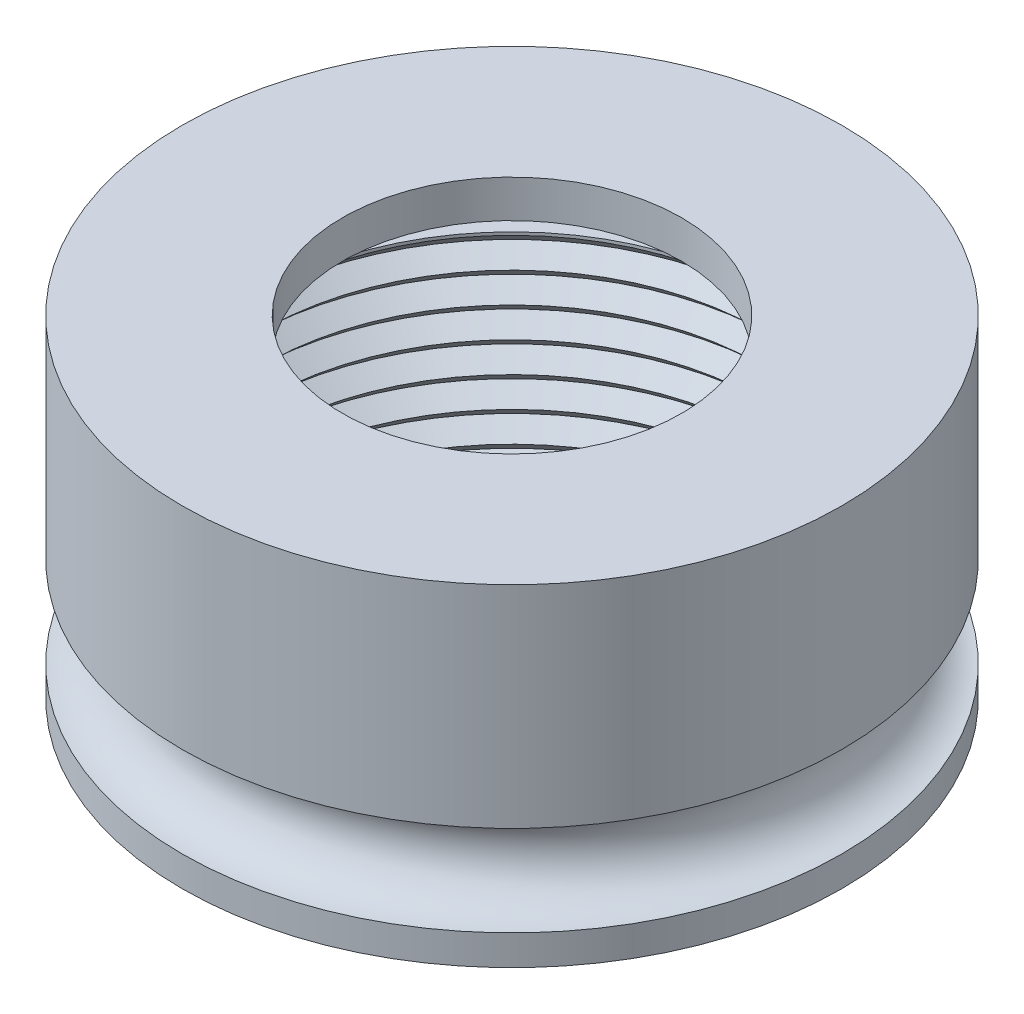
ISO-10303-21;
HEADER;
FILE_DESCRIPTION(('STEP AP214'),'2;1');
FILE_NAME('part.step','',(''),(''),'','','');
FILE_SCHEMA(('AUTOMOTIVE_DESIGN { 1 0 10303 214 1 1 1 1 }'));
ENDSEC;
DATA;
#1=APPLICATION_CONTEXT('core data for automotive mechanical design processes');
#2=APPLICATION_PROTOCOL_DEFINITION('international standard','automotive_design',2000,#1);
#3=PRODUCT_CONTEXT('',#1,'mechanical');
#4=PRODUCT('Part','Part','',(#3));
#5=PRODUCT_RELATED_PRODUCT_CATEGORY('part','',(#4));
#6=PRODUCT_DEFINITION_FORMATION('','',#4);
#7=PRODUCT_DEFINITION_CONTEXT('part definition',#1,'design');
#8=PRODUCT_DEFINITION('design','',#6,#7);
#9=PRODUCT_DEFINITION_SHAPE('','',#8);
#10=(LENGTH_UNIT() NAMED_UNIT(*) SI_UNIT(.MILLI.,.METRE.));
#11=(NAMED_UNIT(*) PLANE_ANGLE_UNIT() SI_UNIT($,.RADIAN.));
#12=(NAMED_UNIT(*) SI_UNIT($,.STERADIAN.) SOLID_ANGLE_UNIT());
#13=UNCERTAINTY_MEASURE_WITH_UNIT(LENGTH_MEASURE(1.E-05),#10,'distance_accuracy_value','');
#14=(GEOMETRIC_REPRESENTATION_CONTEXT(3) GLOBAL_UNCERTAINTY_ASSIGNED_CONTEXT((#13)) GLOBAL_UNIT_ASSIGNED_CONTEXT((#10,
#11,#12)) REPRESENTATION_CONTEXT('',''));
#15=CARTESIAN_POINT('',(0.,0.,0.));
#16=DIRECTION('',(0.,0.,1.));
#17=DIRECTION('',(1.,0.,0.));
#18=AXIS2_PLACEMENT_3D('',#15,#16,#17);
#19=CARTESIAN_POINT('',(0.,0.,0.));
#20=DIRECTION('',(0.,-1.,0.));
#21=DIRECTION('',(0.,0.,-1.));
#22=AXIS2_PLACEMENT_3D('',#19,#20,#21);
#23=CYLINDRICAL_SURFACE('',#22,13.890625);
#24=CARTESIAN_POINT('',(0.,-11.1125,0.));
#25=DIRECTION('',(0.,1.,0.));
#26=DIRECTION('',(0.,0.,1.));
#27=AXIS2_PLACEMENT_3D('',#24,#25,#26);
#28=CIRCLE('',#27,13.890625);
#29=CARTESIAN_POINT('',(0.,-11.1125,13.890625));
#30=VERTEX_POINT('',#29);
#31=EDGE_CURVE('E38',#30,#30,#28,.T.);
#32=ORIENTED_EDGE('',*,*,#31,.F.);
#33=EDGE_LOOP('',(#32));
#34=FACE_BOUND('',#33,.T.);
#35=CARTESIAN_POINT('',(0.,-12.3825,0.));
#36=DIRECTION('',(0.,-1.,0.));
#37=DIRECTION('',(0.,0.,-1.));
#38=AXIS2_PLACEMENT_3D('',#35,#36,#37);
#39=CIRCLE('',#38,13.890625);
#40=CARTESIAN_POINT('',(0.,-12.3825,-13.890625));
#41=VERTEX_POINT('',#40);
#42=EDGE_CURVE('E117',#41,#41,#39,.T.);
#43=ORIENTED_EDGE('',*,*,#42,.F.);
#44=EDGE_LOOP('',(#43));
#45=FACE_BOUND('',#44,.T.);
#46=ADVANCED_FACE('F34',(#34,#45),#23,.T.);
#47=CARTESIAN_POINT('',(11.1125,0.,0.));
#48=DIRECTION('',(0.,-1.,0.));
#49=DIRECTION('',(0.,0.,-1.));
#50=AXIS2_PLACEMENT_3D('',#47,#48,#49);
#51=PLANE('',#50);
#52=CARTESIAN_POINT('',(0.,0.,0.));
#53=DIRECTION('',(0.,-1.,0.));
#54=DIRECTION('',(0.,0.,-1.));
#55=AXIS2_PLACEMENT_3D('',#52,#53,#54);
#56=CIRCLE('',#55,11.1125);
#57=CARTESIAN_POINT('',(0.,0.,-11.1125));
#58=VERTEX_POINT('',#57);
#59=EDGE_CURVE('E55',#58,#58,#56,.T.);
#60=ORIENTED_EDGE('',*,*,#59,.T.);
#61=EDGE_LOOP('',(#60));
#62=FACE_BOUND('',#61,.T.);
#63=CARTESIAN_POINT('',(0.,0.,0.));
#64=DIRECTION('',(0.,-1.,0.));
#65=DIRECTION('',(0.,0.,-1.));
#66=AXIS2_PLACEMENT_3D('',#63,#64,#65);
#67=CIRCLE('',#66,7.14375);
#68=CARTESIAN_POINT('',(0.,0.,-7.14375));
#69=VERTEX_POINT('',#68);
#70=EDGE_CURVE('E10',#69,#69,#67,.T.);
#71=ORIENTED_EDGE('',*,*,#70,.F.);
#72=EDGE_LOOP('',(#71));
#73=FACE_BOUND('',#72,.T.);
#74=ADVANCED_FACE('F36',(#62,#73),#51,.T.);
#75=CARTESIAN_POINT('',(0.,0.,0.));
#76=DIRECTION('',(0.,-1.,0.));
#77=DIRECTION('',(0.,0.,-1.));
#78=AXIS2_PLACEMENT_3D('',#75,#76,#77);
#79=CYLINDRICAL_SURFACE('',#78,7.14375);
#80=ORIENTED_EDGE('',*,*,#70,.T.);
#81=EDGE_LOOP('',(#80));
#82=FACE_BOUND('',#81,.T.);
#83=CARTESIAN_POINT('',(0.,1.5875,0.));
#84=DIRECTION('',(0.,-1.,0.));
#85=DIRECTION('',(0.,0.,-1.));
#86=AXIS2_PLACEMENT_3D('',#83,#84,#85);
#87=CIRCLE('',#86,7.14375);
#88=CARTESIAN_POINT('',(0.,1.5875,-7.14375));
#89=VERTEX_POINT('',#88);
#90=EDGE_CURVE('E42',#89,#89,#87,.T.);
#91=ORIENTED_EDGE('',*,*,#90,.F.);
#92=EDGE_LOOP('',(#91));
#93=FACE_BOUND('',#92,.T.);
#94=ADVANCED_FACE('F126',(#82,#93),#79,.F.);
#95=CARTESIAN_POINT('',(7.14375,1.5875,0.));
#96=DIRECTION('',(0.,1.,0.));
#97=DIRECTION('',(0.,0.,1.));
#98=AXIS2_PLACEMENT_3D('',#95,#96,#97);
#99=PLANE('',#98);
#100=ORIENTED_EDGE('',*,*,#90,.T.);
#101=EDGE_LOOP('',(#100));
#102=FACE_BOUND('',#101,.T.);
#103=CARTESIAN_POINT('',(0.,1.5875,0.));
#104=DIRECTION('',(0.,-1.,0.));
#105=DIRECTION('',(0.,0.,-1.));
#106=AXIS2_PLACEMENT_3D('',#103,#104,#105);
#107=CIRCLE('',#106,13.890625);
#108=CARTESIAN_POINT('',(0.,1.5875,-13.890625));
#109=VERTEX_POINT('',#108);
#110=EDGE_CURVE('E47',#109,#109,#107,.T.);
#111=ORIENTED_EDGE('',*,*,#110,.F.);
#112=EDGE_LOOP('',(#111));
#113=FACE_BOUND('',#112,.T.);
#114=ADVANCED_FACE('F124',(#102,#113),#99,.T.);
#115=CARTESIAN_POINT('',(0.,-7.3025,0.));
#116=DIRECTION('',(0.,-1.,0.));
#117=DIRECTION('',(0.,0.,-1.));
#118=AXIS2_PLACEMENT_3D('',#115,#116,#117);
#119=CIRCLE('',#118,13.890625);
#120=CARTESIAN_POINT('',(0.,-7.3025,-13.890625));
#121=VERTEX_POINT('',#120);
#122=EDGE_CURVE('E50',#121,#121,#119,.T.);
#123=ORIENTED_EDGE('',*,*,#122,.F.);
#124=EDGE_LOOP('',(#123));
#125=FACE_BOUND('',#124,.T.);
#126=ORIENTED_EDGE('',*,*,#110,.T.);
#127=EDGE_LOOP('',(#126));
#128=FACE_BOUND('',#127,.T.);
#129=ADVANCED_FACE('F122',(#125,#128),#23,.T.);
#130=CARTESIAN_POINT('',(13.890625,-12.3825,0.));
#131=DIRECTION('',(0.,-1.,0.));
#132=DIRECTION('',(0.,0.,-1.));
#133=AXIS2_PLACEMENT_3D('',#130,#131,#132);
#134=PLANE('',#133);
#135=ORIENTED_EDGE('',*,*,#42,.T.);
#136=EDGE_LOOP('',(#135));
#137=FACE_BOUND('',#136,.T.);
#138=CARTESIAN_POINT('',(0.,-12.3825,0.));
#139=DIRECTION('',(0.,-1.,0.));
#140=DIRECTION('',(0.,0.,-1.));
#141=AXIS2_PLACEMENT_3D('',#138,#139,#140);
#142=CIRCLE('',#141,11.1125);
#143=CARTESIAN_POINT('',(0.,-12.3825,-11.1125));
#144=VERTEX_POINT('',#143);
#145=EDGE_CURVE('E114',#144,#144,#142,.T.);
#146=ORIENTED_EDGE('',*,*,#145,.F.);
#147=EDGE_LOOP('',(#146));
#148=FACE_BOUND('',#147,.T.);
#149=ADVANCED_FACE('F133',(#137,#148),#134,.T.);
#150=CARTESIAN_POINT('',(0.,-11.7475,0.));
#151=DIRECTION('',(0.,-1.,0.));
#152=DIRECTION('',(0.,0.,-1.));
#153=AXIS2_PLACEMENT_3D('',#150,#151,#152);
#154=CONICAL_SURFACE('',#153,10.42543,0.824763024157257);
#155=ORIENTED_EDGE('',*,*,#145,.T.);
#156=EDGE_LOOP('',(#155));
#157=FACE_BOUND('',#156,.T.);
#158=CARTESIAN_POINT('',(0.,-11.7475,0.));
#159=DIRECTION('',(0.,-1.,0.));
#160=DIRECTION('',(0.,0.,-1.));
#161=AXIS2_PLACEMENT_3D('',#158,#159,#160);
#162=CIRCLE('',#161,10.42543);
#163=CARTESIAN_POINT('',(0.,-11.7475,-10.42543));
#164=VERTEX_POINT('',#163);
#165=EDGE_CURVE('E111',#164,#164,#162,.T.);
#166=ORIENTED_EDGE('',*,*,#165,.F.);
#167=EDGE_LOOP('',(#166));
#168=FACE_BOUND('',#167,.T.);
#169=ADVANCED_FACE('F145',(#157,#168),#154,.F.);
#170=CARTESIAN_POINT('',(0.,-11.1125,0.));
#171=DIRECTION('',(0.,1.,0.));
#172=DIRECTION('',(0.,0.,1.));
#173=AXIS2_PLACEMENT_3D('',#170,#171,#172);
#174=CONICAL_SURFACE('',#173,11.1125,0.824763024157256);
#175=ORIENTED_EDGE('',*,*,#165,.T.);
#176=EDGE_LOOP('',(#175));
#177=FACE_BOUND('',#176,.T.);
#178=CARTESIAN_POINT('',(0.,-11.1125,0.));
#179=DIRECTION('',(0.,-1.,0.));
#180=DIRECTION('',(0.,0.,-1.));
#181=AXIS2_PLACEMENT_3D('',#178,#179,#180);
#182=CIRCLE('',#181,11.1125);
#183=CARTESIAN_POINT('',(0.,-11.1125,-11.1125));
#184=VERTEX_POINT('',#183);
#185=EDGE_CURVE('E108',#184,#184,#182,.T.);
#186=ORIENTED_EDGE('',*,*,#185,.F.);
#187=EDGE_LOOP('',(#186));
#188=FACE_BOUND('',#187,.T.);
#189=ADVANCED_FACE('F149',(#177,#188),#174,.F.);
#190=CARTESIAN_POINT('',(0.,-10.4775,0.));
#191=DIRECTION('',(0.,-1.,0.));
#192=DIRECTION('',(0.,0.,-1.));
#193=AXIS2_PLACEMENT_3D('',#190,#191,#192);
#194=CONICAL_SURFACE('',#193,10.42543,0.824763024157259);
#195=ORIENTED_EDGE('',*,*,#185,.T.);
#196=EDGE_LOOP('',(#195));
#197=FACE_BOUND('',#196,.T.);
#198=CARTESIAN_POINT('',(0.,-10.4775,0.));
#199=DIRECTION('',(0.,-1.,0.));
#200=DIRECTION('',(0.,0.,-1.));
#201=AXIS2_PLACEMENT_3D('',#198,#199,#200);
#202=CIRCLE('',#201,10.42543);
#203=CARTESIAN_POINT('',(0.,-10.4775,-10.42543));
#204=VERTEX_POINT('',#203);
#205=EDGE_CURVE('E105',#204,#204,#202,.T.);
#206=ORIENTED_EDGE('',*,*,#205,.F.);
#207=EDGE_LOOP('',(#206));
#208=FACE_BOUND('',#207,.T.);
#209=ADVANCED_FACE('F153',(#197,#208),#194,.F.);
#210=CARTESIAN_POINT('',(0.,-9.8425,0.));
#211=DIRECTION('',(0.,1.,0.));
#212=DIRECTION('',(0.,0.,1.));
#213=AXIS2_PLACEMENT_3D('',#210,#211,#212);
#214=CONICAL_SURFACE('',#213,11.1125,0.824763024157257);
#215=ORIENTED_EDGE('',*,*,#205,.T.);
#216=EDGE_LOOP('',(#215));
#217=FACE_BOUND('',#216,.T.);
#218=CARTESIAN_POINT('',(0.,-9.8425,0.));
#219=DIRECTION('',(0.,-1.,0.));
#220=DIRECTION('',(0.,0.,-1.));
#221=AXIS2_PLACEMENT_3D('',#218,#219,#220);
#222=CIRCLE('',#221,11.1125);
#223=CARTESIAN_POINT('',(0.,-9.8425,-11.1125));
#224=VERTEX_POINT('',#223);
#225=EDGE_CURVE('E102',#224,#224,#222,.T.);
#226=ORIENTED_EDGE('',*,*,#225,.F.);
#227=EDGE_LOOP('',(#226));
#228=FACE_BOUND('',#227,.T.);
#229=ADVANCED_FACE('F157',(#217,#228),#214,.F.);
#230=CARTESIAN_POINT('',(0.,-9.2075,0.));
#231=DIRECTION('',(0.,-1.,0.));
#232=DIRECTION('',(0.,0.,-1.));
#233=AXIS2_PLACEMENT_3D('',#230,#231,#232);
#234=CONICAL_SURFACE('',#233,10.42543,0.824763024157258);
#235=ORIENTED_EDGE('',*,*,#225,.T.);
#236=EDGE_LOOP('',(#235));
#237=FACE_BOUND('',#236,.T.);
#238=CARTESIAN_POINT('',(0.,-9.2075,0.));
#239=DIRECTION('',(0.,-1.,0.));
#240=DIRECTION('',(0.,0.,-1.));
#241=AXIS2_PLACEMENT_3D('',#238,#239,#240);
#242=CIRCLE('',#241,10.42543);
#243=CARTESIAN_POINT('',(0.,-9.2075,-10.42543));
#244=VERTEX_POINT('',#243);
#245=EDGE_CURVE('E99',#244,#244,#242,.T.);
#246=ORIENTED_EDGE('',*,*,#245,.F.);
#247=EDGE_LOOP('',(#246));
#248=FACE_BOUND('',#247,.T.);
#249=ADVANCED_FACE('F161',(#237,#248),#234,.F.);
#250=CARTESIAN_POINT('',(0.,-8.5725,0.));
#251=DIRECTION('',(0.,1.,0.));
#252=DIRECTION('',(0.,0.,1.));
#253=AXIS2_PLACEMENT_3D('',#250,#251,#252);
#254=CONICAL_SURFACE('',#253,11.1125,0.824763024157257);
#255=ORIENTED_EDGE('',*,*,#245,.T.);
#256=EDGE_LOOP('',(#255));
#257=FACE_BOUND('',#256,.T.);
#258=CARTESIAN_POINT('',(0.,-8.5725,0.));
#259=DIRECTION('',(0.,-1.,0.));
#260=DIRECTION('',(0.,0.,-1.));
#261=AXIS2_PLACEMENT_3D('',#258,#259,#260);
#262=CIRCLE('',#261,11.1125);
#263=CARTESIAN_POINT('',(0.,-8.5725,-11.1125));
#264=VERTEX_POINT('',#263);
#265=EDGE_CURVE('E96',#264,#264,#262,.T.);
#266=ORIENTED_EDGE('',*,*,#265,.F.);
#267=EDGE_LOOP('',(#266));
#268=FACE_BOUND('',#267,.T.);
#269=ADVANCED_FACE('F165',(#257,#268),#254,.F.);
#270=CARTESIAN_POINT('',(0.,-7.9375,0.));
#271=DIRECTION('',(0.,-1.,0.));
#272=DIRECTION('',(0.,0.,-1.));
#273=AXIS2_PLACEMENT_3D('',#270,#271,#272);
#274=CONICAL_SURFACE('',#273,10.42543,0.82476302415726);
#275=ORIENTED_EDGE('',*,*,#265,.T.);
#276=EDGE_LOOP('',(#275));
#277=FACE_BOUND('',#276,.T.);
#278=CARTESIAN_POINT('',(0.,-7.9375,0.));
#279=DIRECTION('',(0.,-1.,0.));
#280=DIRECTION('',(0.,0.,-1.));
#281=AXIS2_PLACEMENT_3D('',#278,#279,#280);
#282=CIRCLE('',#281,10.42543);
#283=CARTESIAN_POINT('',(0.,-7.9375,-10.42543));
#284=VERTEX_POINT('',#283);
#285=EDGE_CURVE('E93',#284,#284,#282,.T.);
#286=ORIENTED_EDGE('',*,*,#285,.F.);
#287=EDGE_LOOP('',(#286));
#288=FACE_BOUND('',#287,.T.);
#289=ADVANCED_FACE('F169',(#277,#288),#274,.F.);
#290=CARTESIAN_POINT('',(0.,-7.3025,0.));
#291=DIRECTION('',(0.,1.,0.));
#292=DIRECTION('',(0.,0.,1.));
#293=AXIS2_PLACEMENT_3D('',#290,#291,#292);
#294=CONICAL_SURFACE('',#293,11.1125,0.824763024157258);
#295=ORIENTED_EDGE('',*,*,#285,.T.);
#296=EDGE_LOOP('',(#295));
#297=FACE_BOUND('',#296,.T.);
#298=CARTESIAN_POINT('',(0.,-7.3025,0.));
#299=DIRECTION('',(0.,-1.,0.));
#300=DIRECTION('',(0.,0.,-1.));
#301=AXIS2_PLACEMENT_3D('',#298,#299,#300);
#302=CIRCLE('',#301,11.1125);
#303=CARTESIAN_POINT('',(0.,-7.3025,-11.1125));
#304=VERTEX_POINT('',#303);
#305=EDGE_CURVE('E90',#304,#304,#302,.T.);
#306=ORIENTED_EDGE('',*,*,#305,.F.);
#307=EDGE_LOOP('',(#306));
#308=FACE_BOUND('',#307,.T.);
#309=ADVANCED_FACE('F173',(#297,#308),#294,.F.);
#310=CARTESIAN_POINT('',(0.,-6.6675,0.));
#311=DIRECTION('',(0.,-1.,0.));
#312=DIRECTION('',(0.,0.,-1.));
#313=AXIS2_PLACEMENT_3D('',#310,#311,#312);
#314=CONICAL_SURFACE('',#313,10.42543,0.824763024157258);
#315=ORIENTED_EDGE('',*,*,#305,.T.);
#316=EDGE_LOOP('',(#315));
#317=FACE_BOUND('',#316,.T.);
#318=CARTESIAN_POINT('',(0.,-6.6675,0.));
#319=DIRECTION('',(0.,-1.,0.));
#320=DIRECTION('',(0.,0.,-1.));
#321=AXIS2_PLACEMENT_3D('',#318,#319,#320);
#322=CIRCLE('',#321,10.42543);
#323=CARTESIAN_POINT('',(0.,-6.6675,-10.42543));
#324=VERTEX_POINT('',#323);
#325=EDGE_CURVE('E87',#324,#324,#322,.T.);
#326=ORIENTED_EDGE('',*,*,#325,.F.);
#327=EDGE_LOOP('',(#326));
#328=FACE_BOUND('',#327,.T.);
#329=ADVANCED_FACE('F177',(#317,#328),#314,.F.);
#330=CARTESIAN_POINT('',(0.,-6.03249999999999,0.));
#331=DIRECTION('',(0.,1.,0.));
#332=DIRECTION('',(0.,0.,1.));
#333=AXIS2_PLACEMENT_3D('',#330,#331,#332);
#334=CONICAL_SURFACE('',#333,11.1125,0.824763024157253);
#335=ORIENTED_EDGE('',*,*,#325,.T.);
#336=EDGE_LOOP('',(#335));
#337=FACE_BOUND('',#336,.T.);
#338=CARTESIAN_POINT('',(0.,-6.03249999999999,0.));
#339=DIRECTION('',(0.,-1.,0.));
#340=DIRECTION('',(0.,0.,-1.));
#341=AXIS2_PLACEMENT_3D('',#338,#339,#340);
#342=CIRCLE('',#341,11.1125);
#343=CARTESIAN_POINT('',(0.,-6.03249999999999,-11.1125));
#344=VERTEX_POINT('',#343);
#345=EDGE_CURVE('E84',#344,#344,#342,.T.);
#346=ORIENTED_EDGE('',*,*,#345,.F.);
#347=EDGE_LOOP('',(#346));
#348=FACE_BOUND('',#347,.T.);
#349=ADVANCED_FACE('F181',(#337,#348),#334,.F.);
#350=CARTESIAN_POINT('',(0.,-5.3975,0.));
#351=DIRECTION('',(0.,-1.,0.));
#352=DIRECTION('',(0.,0.,-1.));
#353=AXIS2_PLACEMENT_3D('',#350,#351,#352);
#354=CONICAL_SURFACE('',#353,10.42543,0.824763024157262);
#355=ORIENTED_EDGE('',*,*,#345,.T.);
#356=EDGE_LOOP('',(#355));
#357=FACE_BOUND('',#356,.T.);
#358=CARTESIAN_POINT('',(0.,-5.3975,0.));
#359=DIRECTION('',(0.,-1.,0.));
#360=DIRECTION('',(0.,0.,-1.));
#361=AXIS2_PLACEMENT_3D('',#358,#359,#360);
#362=CIRCLE('',#361,10.42543);
#363=CARTESIAN_POINT('',(0.,-5.3975,-10.42543));
#364=VERTEX_POINT('',#363);
#365=EDGE_CURVE('E81',#364,#364,#362,.T.);
#366=ORIENTED_EDGE('',*,*,#365,.F.);
#367=EDGE_LOOP('',(#366));
#368=FACE_BOUND('',#367,.T.);
#369=ADVANCED_FACE('F185',(#357,#368),#354,.F.);
#370=CARTESIAN_POINT('',(0.,-4.7625,0.));
#371=DIRECTION('',(0.,1.,0.));
#372=DIRECTION('',(0.,0.,1.));
#373=AXIS2_PLACEMENT_3D('',#370,#371,#372);
#374=CONICAL_SURFACE('',#373,11.1125,0.824763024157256);
#375=ORIENTED_EDGE('',*,*,#365,.T.);
#376=EDGE_LOOP('',(#375));
#377=FACE_BOUND('',#376,.T.);
#378=CARTESIAN_POINT('',(0.,-4.7625,0.));
#379=DIRECTION('',(0.,-1.,0.));
#380=DIRECTION('',(0.,0.,-1.));
#381=AXIS2_PLACEMENT_3D('',#378,#379,#380);
#382=CIRCLE('',#381,11.1125);
#383=CARTESIAN_POINT('',(0.,-4.7625,-11.1125));
#384=VERTEX_POINT('',#383);
#385=EDGE_CURVE('E78',#384,#384,#382,.T.);
#386=ORIENTED_EDGE('',*,*,#385,.F.);
#387=EDGE_LOOP('',(#386));
#388=FACE_BOUND('',#387,.T.);
#389=ADVANCED_FACE('F189',(#377,#388),#374,.F.);
#390=CARTESIAN_POINT('',(0.,-4.1275,0.));
#391=DIRECTION('',(0.,-1.,0.));
#392=DIRECTION('',(0.,0.,-1.));
#393=AXIS2_PLACEMENT_3D('',#390,#391,#392);
#394=CONICAL_SURFACE('',#393,10.42543,0.824763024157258);
#395=ORIENTED_EDGE('',*,*,#385,.T.);
#396=EDGE_LOOP('',(#395));
#397=FACE_BOUND('',#396,.T.);
#398=CARTESIAN_POINT('',(0.,-4.1275,0.));
#399=DIRECTION('',(0.,-1.,0.));
#400=DIRECTION('',(0.,0.,-1.));
#401=AXIS2_PLACEMENT_3D('',#398,#399,#400);
#402=CIRCLE('',#401,10.42543);
#403=CARTESIAN_POINT('',(0.,-4.1275,-10.42543));
#404=VERTEX_POINT('',#403);
#405=EDGE_CURVE('E75',#404,#404,#402,.T.);
#406=ORIENTED_EDGE('',*,*,#405,.F.);
#407=EDGE_LOOP('',(#406));
#408=FACE_BOUND('',#407,.T.);
#409=ADVANCED_FACE('F193',(#397,#408),#394,.F.);
#410=CARTESIAN_POINT('',(0.,-3.49249999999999,0.));
#411=DIRECTION('',(0.,1.,0.));
#412=DIRECTION('',(0.,0.,1.));
#413=AXIS2_PLACEMENT_3D('',#410,#411,#412);
#414=CONICAL_SURFACE('',#413,11.1125,0.824763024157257);
#415=ORIENTED_EDGE('',*,*,#405,.T.);
#416=EDGE_LOOP('',(#415));
#417=FACE_BOUND('',#416,.T.);
#418=CARTESIAN_POINT('',(0.,-3.49249999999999,0.));
#419=DIRECTION('',(0.,-1.,0.));
#420=DIRECTION('',(0.,0.,-1.));
#421=AXIS2_PLACEMENT_3D('',#418,#419,#420);
#422=CIRCLE('',#421,11.1125);
#423=CARTESIAN_POINT('',(0.,-3.49249999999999,-11.1125));
#424=VERTEX_POINT('',#423);
#425=EDGE_CURVE('E72',#424,#424,#422,.T.);
#426=ORIENTED_EDGE('',*,*,#425,.F.);
#427=EDGE_LOOP('',(#426));
#428=FACE_BOUND('',#427,.T.);
#429=ADVANCED_FACE('F197',(#417,#428),#414,.F.);
#430=CARTESIAN_POINT('',(0.,-2.85749999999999,0.));
#431=DIRECTION('',(0.,-1.,0.));
#432=DIRECTION('',(0.,0.,-1.));
#433=AXIS2_PLACEMENT_3D('',#430,#431,#432);
#434=CONICAL_SURFACE('',#433,10.42543,0.824763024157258);
#435=ORIENTED_EDGE('',*,*,#425,.T.);
#436=EDGE_LOOP('',(#435));
#437=FACE_BOUND('',#436,.T.);
#438=CARTESIAN_POINT('',(0.,-2.85749999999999,0.));
#439=DIRECTION('',(0.,-1.,0.));
#440=DIRECTION('',(0.,0.,-1.));
#441=AXIS2_PLACEMENT_3D('',#438,#439,#440);
#442=CIRCLE('',#441,10.42543);
#443=CARTESIAN_POINT('',(0.,-2.85749999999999,-10.42543));
#444=VERTEX_POINT('',#443);
#445=EDGE_CURVE('E69',#444,#444,#442,.T.);
#446=ORIENTED_EDGE('',*,*,#445,.F.);
#447=EDGE_LOOP('',(#446));
#448=FACE_BOUND('',#447,.T.);
#449=ADVANCED_FACE('F201',(#437,#448),#434,.F.);
#450=CARTESIAN_POINT('',(0.,0.,0.));
#451=DIRECTION('',(0.,-1.,0.));
#452=DIRECTION('',(0.,0.,-1.));
#453=AXIS2_PLACEMENT_3D('',#450,#451,#452);
#454=CYLINDRICAL_SURFACE('',#453,10.42543);
#455=ORIENTED_EDGE('',*,*,#445,.T.);
#456=EDGE_LOOP('',(#455));
#457=FACE_BOUND('',#456,.T.);
#458=CARTESIAN_POINT('',(0.,-2.7305,0.));
#459=DIRECTION('',(0.,-1.,0.));
#460=DIRECTION('',(0.,0.,-1.));
#461=AXIS2_PLACEMENT_3D('',#458,#459,#460);
#462=CIRCLE('',#461,10.42543);
#463=CARTESIAN_POINT('',(0.,-2.7305,-10.42543));
#464=VERTEX_POINT('',#463);
#465=EDGE_CURVE('E64',#464,#464,#462,.T.);
#466=ORIENTED_EDGE('',*,*,#465,.F.);
#467=EDGE_LOOP('',(#466));
#468=FACE_BOUND('',#467,.T.);
#469=ADVANCED_FACE('F205',(#457,#468),#454,.F.);
#470=CARTESIAN_POINT('',(11.1125,-2.7305,0.));
#471=DIRECTION('',(0.,1.,0.));
#472=DIRECTION('',(0.,0.,1.));
#473=AXIS2_PLACEMENT_3D('',#470,#471,#472);
#474=PLANE('',#473);
#475=ORIENTED_EDGE('',*,*,#465,.T.);
#476=EDGE_LOOP('',(#475));
#477=FACE_BOUND('',#476,.T.);
#478=CARTESIAN_POINT('',(0.,-2.7305,0.));
#479=DIRECTION('',(0.,-1.,0.));
#480=DIRECTION('',(0.,0.,-1.));
#481=AXIS2_PLACEMENT_3D('',#478,#479,#480);
#482=CIRCLE('',#481,11.1125);
#483=CARTESIAN_POINT('',(0.,-2.7305,-11.1125));
#484=VERTEX_POINT('',#483);
#485=EDGE_CURVE('E59',#484,#484,#482,.T.);
#486=ORIENTED_EDGE('',*,*,#485,.F.);
#487=EDGE_LOOP('',(#486));
#488=FACE_BOUND('',#487,.T.);
#489=ADVANCED_FACE('F209',(#477,#488),#474,.T.);
#490=CARTESIAN_POINT('',(0.,0.,0.));
#491=DIRECTION('',(0.,-1.,0.));
#492=DIRECTION('',(0.,0.,-1.));
#493=AXIS2_PLACEMENT_3D('',#490,#491,#492);
#494=CYLINDRICAL_SURFACE('',#493,11.1125);
#495=ORIENTED_EDGE('',*,*,#485,.T.);
#496=EDGE_LOOP('',(#495));
#497=FACE_BOUND('',#496,.T.);
#498=ORIENTED_EDGE('',*,*,#59,.F.);
#499=EDGE_LOOP('',(#498));
#500=FACE_BOUND('',#499,.T.);
#501=ADVANCED_FACE('F213',(#497,#500),#494,.F.);
#502=CARTESIAN_POINT('',(0.,-9.2075,0.));
#503=DIRECTION('',(0.,-1.,0.));
#504=DIRECTION('',(0.,0.,-1.));
#505=AXIS2_PLACEMENT_3D('',#502,#503,#504);
#506=TOROIDAL_SURFACE('',#505,13.890625,1.905);
#507=ORIENTED_EDGE('',*,*,#31,.T.);
#508=EDGE_LOOP('',(#507));
#509=FACE_BOUND('',#508,.T.);
#510=ORIENTED_EDGE('',*,*,#122,.T.);
#511=EDGE_LOOP('',(#510));
#512=FACE_BOUND('',#511,.T.);
#513=ADVANCED_FACE('F217',(#509,#512),#506,.F.);
#514=CLOSED_SHELL('',(#46,#74,#94,#114,#129,#149,#169,#189,#209,#229,#249,#269,#289,#309,#329,
#349,#369,#389,#409,#429,#449,#469,#489,#501,#513));
#515=MANIFOLD_SOLID_BREP('B2',#514);
#516=ADVANCED_BREP_SHAPE_REPRESENTATION('',(#18,#515),#14);
#517=SHAPE_DEFINITION_REPRESENTATION(#9,#516);
ENDSEC;
END-ISO-10303-21;
